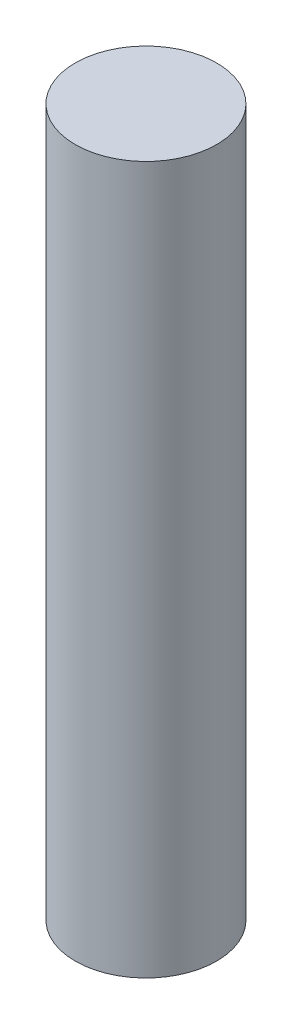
ISO-10303-21;
HEADER;
FILE_DESCRIPTION(('STEP AP214'),'2;1');
FILE_NAME('part.step','',(''),(''),'','','');
FILE_SCHEMA(('AUTOMOTIVE_DESIGN { 1 0 10303 214 1 1 1 1 }'));
ENDSEC;
DATA;
#1=APPLICATION_CONTEXT('core data for automotive mechanical design processes');
#2=APPLICATION_PROTOCOL_DEFINITION('international standard','automotive_design',2000,#1);
#3=PRODUCT_CONTEXT('',#1,'mechanical');
#4=PRODUCT('Part','Part','',(#3));
#5=PRODUCT_RELATED_PRODUCT_CATEGORY('part','',(#4));
#6=PRODUCT_DEFINITION_FORMATION('','',#4);
#7=PRODUCT_DEFINITION_CONTEXT('part definition',#1,'design');
#8=PRODUCT_DEFINITION('design','',#6,#7);
#9=PRODUCT_DEFINITION_SHAPE('','',#8);
#10=(LENGTH_UNIT() NAMED_UNIT(*) SI_UNIT(.MILLI.,.METRE.));
#11=(NAMED_UNIT(*) PLANE_ANGLE_UNIT() SI_UNIT($,.RADIAN.));
#12=(NAMED_UNIT(*) SI_UNIT($,.STERADIAN.) SOLID_ANGLE_UNIT());
#13=UNCERTAINTY_MEASURE_WITH_UNIT(LENGTH_MEASURE(1.E-05),#10,'distance_accuracy_value','');
#14=(GEOMETRIC_REPRESENTATION_CONTEXT(3) GLOBAL_UNCERTAINTY_ASSIGNED_CONTEXT((#13)) GLOBAL_UNIT_ASSIGNED_CONTEXT((#10,
#11,#12)) REPRESENTATION_CONTEXT('',''));
#15=CARTESIAN_POINT('',(0.,0.,0.));
#16=DIRECTION('',(0.,0.,1.));
#17=DIRECTION('',(1.,0.,0.));
#18=AXIS2_PLACEMENT_3D('',#15,#16,#17);
#19=CARTESIAN_POINT('',(0.,6.99999999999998,0.));
#20=DIRECTION('',(0.,-1.,0.));
#21=DIRECTION('',(0.,0.,-1.));
#22=AXIS2_PLACEMENT_3D('',#19,#20,#21);
#23=CYLINDRICAL_SURFACE('',#22,0.7);
#24=CARTESIAN_POINT('',(0.,6.99999999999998,0.));
#25=DIRECTION('',(0.,1.,0.));
#26=DIRECTION('',(0.,0.,1.));
#27=AXIS2_PLACEMENT_3D('',#24,#25,#26);
#28=CIRCLE('',#27,0.7);
#29=CARTESIAN_POINT('',(0.,6.99999999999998,0.700000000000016));
#30=VERTEX_POINT('',#29);
#31=EDGE_CURVE('E12',#30,#30,#28,.T.);
#32=ORIENTED_EDGE('',*,*,#31,.F.);
#33=EDGE_LOOP('',(#32));
#34=FACE_BOUND('',#33,.T.);
#35=CARTESIAN_POINT('',(0.,0.,0.));
#36=DIRECTION('',(0.,1.,0.));
#37=DIRECTION('',(0.,0.,1.));
#38=AXIS2_PLACEMENT_3D('',#35,#36,#37);
#39=CIRCLE('',#38,0.7);
#40=CARTESIAN_POINT('',(0.,0.,0.700000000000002));
#41=VERTEX_POINT('',#40);
#42=EDGE_CURVE('E49',#41,#41,#39,.T.);
#43=ORIENTED_EDGE('',*,*,#42,.T.);
#44=EDGE_LOOP('',(#43));
#45=FACE_BOUND('',#44,.T.);
#46=ADVANCED_FACE('F46',(#34,#45),#23,.T.);
#47=CARTESIAN_POINT('',(0.,6.99999999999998,0.));
#48=DIRECTION('',(0.,1.,0.));
#49=DIRECTION('',(0.,0.,1.));
#50=AXIS2_PLACEMENT_3D('',#47,#48,#49);
#51=PLANE('',#50);
#52=ORIENTED_EDGE('',*,*,#31,.T.);
#53=EDGE_LOOP('',(#52));
#54=FACE_BOUND('',#53,.T.);
#55=ADVANCED_FACE('F61',(#54),#51,.T.);
#56=CARTESIAN_POINT('',(0.,0.,0.));
#57=DIRECTION('',(0.,1.,0.));
#58=DIRECTION('',(0.,0.,1.));
#59=AXIS2_PLACEMENT_3D('',#56,#57,#58);
#60=PLANE('',#59);
#61=ORIENTED_EDGE('',*,*,#42,.F.);
#62=EDGE_LOOP('',(#61));
#63=FACE_BOUND('',#62,.T.);
#64=ADVANCED_FACE('F59',(#63),#60,.F.);
#65=CLOSED_SHELL('',(#46,#55,#64));
#66=MANIFOLD_SOLID_BREP('B2',#65);
#67=ADVANCED_BREP_SHAPE_REPRESENTATION('',(#18,#66),#14);
#68=SHAPE_DEFINITION_REPRESENTATION(#9,#67);
ENDSEC;
END-ISO-10303-21;
